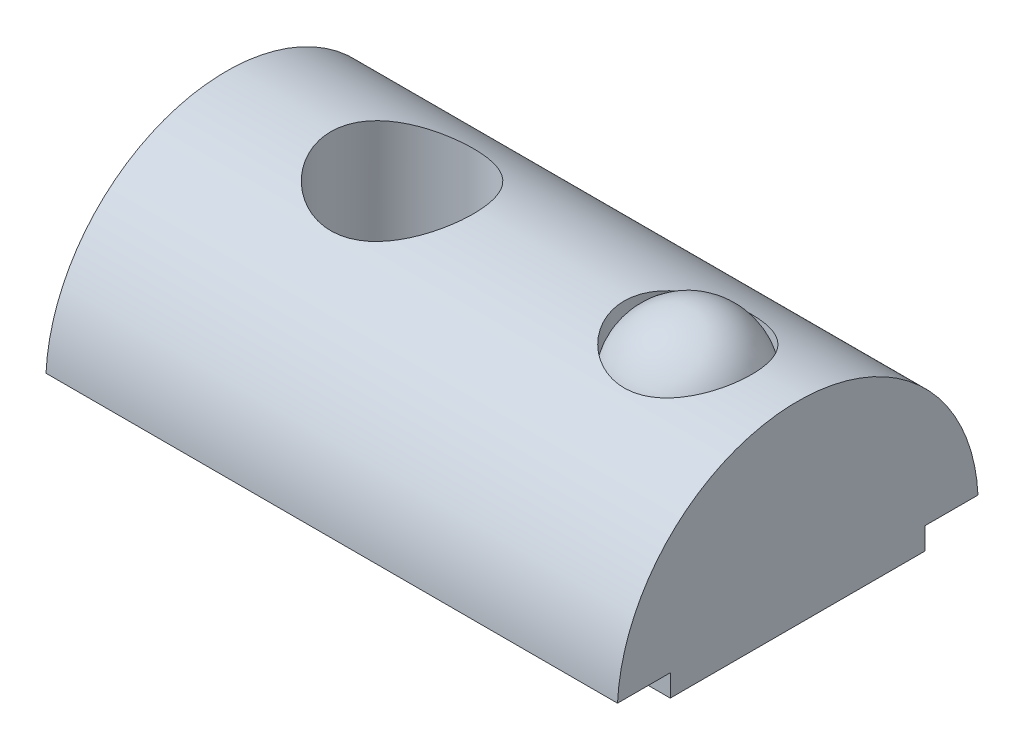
ISO-10303-21;
HEADER;
FILE_DESCRIPTION(('STEP AP214'),'2;1');
FILE_NAME('part.step','',(''),(''),'','','');
FILE_SCHEMA(('AUTOMOTIVE_DESIGN { 1 0 10303 214 1 1 1 1 }'));
ENDSEC;
DATA;
#1=APPLICATION_CONTEXT('core data for automotive mechanical design processes');
#2=APPLICATION_PROTOCOL_DEFINITION('international standard','automotive_design',2000,#1);
#3=PRODUCT_CONTEXT('',#1,'mechanical');
#4=PRODUCT('Part','Part','',(#3));
#5=PRODUCT_RELATED_PRODUCT_CATEGORY('part','',(#4));
#6=PRODUCT_DEFINITION_FORMATION('','',#4);
#7=PRODUCT_DEFINITION_CONTEXT('part definition',#1,'design');
#8=PRODUCT_DEFINITION('design','',#6,#7);
#9=PRODUCT_DEFINITION_SHAPE('','',#8);
#10=(LENGTH_UNIT() NAMED_UNIT(*) SI_UNIT(.MILLI.,.METRE.));
#11=(NAMED_UNIT(*) PLANE_ANGLE_UNIT() SI_UNIT($,.RADIAN.));
#12=(NAMED_UNIT(*) SI_UNIT($,.STERADIAN.) SOLID_ANGLE_UNIT());
#13=UNCERTAINTY_MEASURE_WITH_UNIT(LENGTH_MEASURE(1.E-05),#10,'distance_accuracy_value','');
#14=(GEOMETRIC_REPRESENTATION_CONTEXT(3) GLOBAL_UNCERTAINTY_ASSIGNED_CONTEXT((#13)) GLOBAL_UNIT_ASSIGNED_CONTEXT((#10,
#11,#12)) REPRESENTATION_CONTEXT('',''));
#15=CARTESIAN_POINT('',(0.,0.,0.));
#16=DIRECTION('',(0.,0.,1.));
#17=DIRECTION('',(1.,0.,0.));
#18=AXIS2_PLACEMENT_3D('',#15,#16,#17);
#19=CARTESIAN_POINT('',(6.5,0.,0.));
#20=DIRECTION('',(0.,-1.,0.));
#21=DIRECTION('',(0.,0.,-1.));
#22=AXIS2_PLACEMENT_3D('',#19,#20,#21);
#23=CYLINDRICAL_SURFACE('',#22,1.45);
#24=CARTESIAN_POINT('',(5.05,4.4,0.));
#25=CARTESIAN_POINT('',(5.04999859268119,4.40000099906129,-0.078842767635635));
#26=CARTESIAN_POINT('',(5.05645110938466,4.39770821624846,-0.15767548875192));
#27=CARTESIAN_POINT('',(5.08200001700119,4.38878913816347,-0.313002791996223));
#28=CARTESIAN_POINT('',(5.10109622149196,4.38216290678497,-0.38949740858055));
#29=CARTESIAN_POINT('',(5.15118497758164,4.36529291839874,-0.537886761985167));
#30=CARTESIAN_POINT('',(5.18215620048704,4.35505564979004,-0.609789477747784));
#31=CARTESIAN_POINT('',(5.2550138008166,4.33199662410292,-0.747377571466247));
#32=CARTESIAN_POINT('',(5.29690272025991,4.31917426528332,-0.813061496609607));
#33=CARTESIAN_POINT('',(5.39208844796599,4.29173320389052,-0.938864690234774));
#34=CARTESIAN_POINT('',(5.44572938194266,4.27706774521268,-0.998713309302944));
#35=CARTESIAN_POINT('',(5.56216551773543,4.24783766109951,-1.1087774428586));
#36=CARTESIAN_POINT('',(5.62496307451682,4.23327306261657,-1.15899047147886));
#37=CARTESIAN_POINT('',(5.76046226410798,4.20536583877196,-1.2499834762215));
#38=CARTESIAN_POINT('',(5.8334223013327,4.19207938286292,-1.29039757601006));
#39=CARTESIAN_POINT('',(5.9856481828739,4.16895141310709,-1.35826349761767));
#40=CARTESIAN_POINT('',(6.06491181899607,4.15910869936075,-1.38571983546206));
#41=CARTESIAN_POINT('',(6.22439747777,4.14447842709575,-1.42585063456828));
#42=CARTESIAN_POINT('',(6.30447422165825,4.13951647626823,-1.43903687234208));
#43=CARTESIAN_POINT('',(6.46584562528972,4.13469607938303,-1.45185348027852));
#44=CARTESIAN_POINT('',(6.54713984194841,4.13483581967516,-1.45148866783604));
#45=CARTESIAN_POINT('',(6.70413177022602,4.14005132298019,-1.43760804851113));
#46=CARTESIAN_POINT('',(6.77990028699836,4.14486935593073,-1.42477888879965));
#47=CARTESIAN_POINT('',(6.9281305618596,4.15847378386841,-1.38746084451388));
#48=CARTESIAN_POINT('',(7.00059187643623,4.16726070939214,-1.36297040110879));
#49=CARTESIAN_POINT('',(7.14163570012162,4.18798301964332,-1.30260983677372));
#50=CARTESIAN_POINT('',(7.2101282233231,4.1999707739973,-1.26654821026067));
#51=CARTESIAN_POINT('',(7.34029857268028,4.22572416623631,-1.18420203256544));
#52=CARTESIAN_POINT('',(7.401974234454,4.23949036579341,-1.13791424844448));
#53=CARTESIAN_POINT('',(7.52059277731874,4.26824304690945,-1.03320447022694));
#54=CARTESIAN_POINT('',(7.57704066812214,4.28325356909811,-0.974227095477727));
#55=CARTESIAN_POINT('',(7.67938243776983,4.31209777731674,-0.847462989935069));
#56=CARTESIAN_POINT('',(7.72527504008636,4.32593132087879,-0.779675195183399));
#57=CARTESIAN_POINT('',(7.805668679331,4.35108536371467,-0.636066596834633));
#58=CARTESIAN_POINT('',(7.84002222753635,4.36237276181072,-0.560157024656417));
#59=CARTESIAN_POINT('',(7.89531297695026,4.38092030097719,-0.403140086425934));
#60=CARTESIAN_POINT('',(7.91625543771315,4.38818202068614,-0.322034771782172));
#61=CARTESIAN_POINT('',(7.94321815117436,4.39759103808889,-0.161107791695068));
#62=CARTESIAN_POINT('',(7.94990615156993,4.39996700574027,-0.0814112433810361));
#63=CARTESIAN_POINT('',(7.95009183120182,4.40003228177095,0.0779905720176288));
#64=CARTESIAN_POINT('',(7.94359205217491,4.39772249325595,0.157695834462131));
#65=CARTESIAN_POINT('',(7.91810603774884,4.38882692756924,0.312081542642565));
#66=CARTESIAN_POINT('',(7.89954239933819,4.38238596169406,0.386840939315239));
#67=CARTESIAN_POINT('',(7.85099693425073,4.36602032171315,0.532144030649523));
#68=CARTESIAN_POINT('',(7.82101362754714,4.35609519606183,0.602687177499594));
#69=CARTESIAN_POINT('',(7.74956045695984,4.33341139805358,0.739755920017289));
#70=CARTESIAN_POINT('',(7.70779326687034,4.3205813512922,0.806114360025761));
#71=CARTESIAN_POINT('',(7.61430066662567,4.2935270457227,0.931090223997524));
#72=CARTESIAN_POINT('',(7.56257190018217,4.27930231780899,0.989705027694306));
#73=CARTESIAN_POINT('',(7.44749328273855,4.25013050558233,1.10066665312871));
#74=CARTESIAN_POINT('',(7.38368341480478,4.23518379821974,1.1525376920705));
#75=CARTESIAN_POINT('',(7.24795400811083,4.20698304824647,1.24491080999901));
#76=CARTESIAN_POINT('',(7.17603413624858,4.19372907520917,1.28541242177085));
#77=CARTESIAN_POINT('',(7.02586290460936,4.17051558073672,1.3538002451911));
#78=CARTESIAN_POINT('',(6.94760853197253,4.16055763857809,1.38168041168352));
#79=CARTESIAN_POINT('',(6.78707414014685,4.14527750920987,1.42371463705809));
#80=CARTESIAN_POINT('',(6.70479626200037,4.13995288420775,1.43787591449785));
#81=CARTESIAN_POINT('',(6.54363897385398,4.13484166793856,1.4514669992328));
#82=CARTESIAN_POINT('',(6.46483586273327,4.13475450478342,1.451696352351));
#83=CARTESIAN_POINT('',(6.30837805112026,4.13937209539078,1.43942247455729));
#84=CARTESIAN_POINT('',(6.23072326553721,4.14407649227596,1.42692019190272));
#85=CARTESIAN_POINT('',(6.08063909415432,4.15751054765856,1.39013172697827));
#86=CARTESIAN_POINT('',(6.00812904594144,4.16614094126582,1.36613541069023));
#87=CARTESIAN_POINT('',(5.86811356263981,4.18640761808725,1.30728362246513));
#88=CARTESIAN_POINT('',(5.80060932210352,4.19804461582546,1.27242556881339));
#89=CARTESIAN_POINT('',(5.66901206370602,4.22370761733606,1.19089625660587));
#90=CARTESIAN_POINT('',(5.60523732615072,4.23782135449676,1.14373912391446));
#91=CARTESIAN_POINT('',(5.48624921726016,4.26651217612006,1.03973892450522));
#92=CARTESIAN_POINT('',(5.43103841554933,4.28108939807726,0.982892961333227));
#93=CARTESIAN_POINT('',(5.32818371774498,4.30986600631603,0.858010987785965));
#94=CARTESIAN_POINT('',(5.28100181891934,4.32401756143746,0.789581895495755));
#95=CARTESIAN_POINT('',(5.19884587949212,4.34962842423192,0.645281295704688));
#96=CARTESIAN_POINT('',(5.16387053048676,4.36108802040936,0.569410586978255));
#97=CARTESIAN_POINT('',(5.10747414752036,4.37996651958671,0.412648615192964));
#98=CARTESIAN_POINT('',(5.08599794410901,4.38740185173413,0.331779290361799));
#99=CARTESIAN_POINT('',(5.05726423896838,4.39741716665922,0.167268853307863));
#100=CARTESIAN_POINT('',(5.05000149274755,4.39999894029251,0.0836287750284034));
#101=CARTESIAN_POINT('',(5.05,4.4,0.));
#102=B_SPLINE_CURVE_WITH_KNOTS('',3,(#24,#25,#26,#27,#28,#29,#30,#31,#32,#33,#34,#35,#36,#37,
#38,#39,#40,#41,#42,#43,#44,#45,#46,#47,#48,#49,#50,#51,#52,#53,#54,#55,#56,#57,#58,#59,#60,#61,
#62,#63,#64,#65,#66,#67,#68,#69,#70,#71,#72,#73,#74,#75,#76,#77,#78,#79,#80,#81,#82,#83,#84,#85,
#86,#87,#88,#89,#90,#91,#92,#93,#94,#95,#96,#97,#98,#99,#100,#101),.UNSPECIFIED.,.T.,.F.,(4,2,2,
2,2,2,2,2,2,2,2,2,2,2,2,2,2,2,2,2,2,2,2,2,2,2,2,2,2,2,2,2,2,2,2,2,2,2,4),(0.,0.236220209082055,
0.472436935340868,0.708231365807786,0.944080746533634,1.18807833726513,1.43213879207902,
1.68425139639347,1.93627606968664,2.17892768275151,2.42149303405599,2.65141171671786,
2.88136114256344,3.11533165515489,3.34937624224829,3.59725016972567,3.84515405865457,
4.096115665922,4.34697879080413,4.58580567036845,4.82458652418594,5.05542354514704,
5.28629049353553,5.52360311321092,5.76099582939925,6.01056639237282,6.26014720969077,
6.50984743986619,6.75941621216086,6.99464797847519,7.22986222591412,7.4594341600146,
7.68906070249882,7.92968636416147,8.17038408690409,8.42209853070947,8.6737859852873,
8.92443801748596,9.17499754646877),.UNSPECIFIED.);
#103=CARTESIAN_POINT('',(5.05,4.4,0.));
#104=VERTEX_POINT('',#103);
#105=EDGE_CURVE('E45',#104,#104,#102,.T.);
#106=ORIENTED_EDGE('',*,*,#105,.F.);
#107=EDGE_LOOP('',(#106));
#108=FACE_BOUND('',#107,.T.);
#109=CARTESIAN_POINT('',(6.5,3.88405728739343,0.));
#110=DIRECTION('',(0.,-1.,0.));
#111=DIRECTION('',(0.,0.,-1.));
#112=AXIS2_PLACEMENT_3D('',#109,#110,#111);
#113=CIRCLE('',#112,1.45);
#114=CARTESIAN_POINT('',(6.5,3.88405728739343,-1.45));
#115=VERTEX_POINT('',#114);
#116=EDGE_CURVE('E11',#115,#115,#113,.F.);
#117=ORIENTED_EDGE('',*,*,#116,.F.);
#118=EDGE_LOOP('',(#117));
#119=FACE_BOUND('',#118,.T.);
#120=ADVANCED_FACE('F35',(#108,#119),#23,.F.);
#121=CARTESIAN_POINT('',(9.,0.294871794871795,0.));
#122=DIRECTION('',(-1.,0.,0.));
#123=DIRECTION('',(0.,0.,1.));
#124=AXIS2_PLACEMENT_3D('',#121,#122,#123);
#125=CYLINDRICAL_SURFACE('',#124,4.1051282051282);
#126=ORIENTED_EDGE('',*,*,#105,.T.);
#127=EDGE_LOOP('',(#126));
#128=FACE_BOUND('',#127,.T.);
#129=CARTESIAN_POINT('',(-1.621,4.4,0.));
#130=CARTESIAN_POINT('',(-1.6209910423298,4.39999348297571,-0.0872351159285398));
#131=CARTESIAN_POINT('',(-1.61391806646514,4.39718734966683,-0.174599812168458));
#132=CARTESIAN_POINT('',(-1.58586906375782,4.38623575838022,-0.346865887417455));
#133=CARTESIAN_POINT('',(-1.56485766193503,4.37807671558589,-0.431760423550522));
#134=CARTESIAN_POINT('',(-1.50981328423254,4.35730053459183,-0.596326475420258));
#135=CARTESIAN_POINT('',(-1.47582151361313,4.34469751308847,-0.676013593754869));
#136=CARTESIAN_POINT('',(-1.39594396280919,4.31627790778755,-0.828488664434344));
#137=CARTESIAN_POINT('',(-1.35006177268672,4.30046229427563,-0.901278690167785));
#138=CARTESIAN_POINT('',(-1.24546980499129,4.26640650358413,-1.04134652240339));
#139=CARTESIAN_POINT('',(-1.18630209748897,4.24809238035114,-1.10826427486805));
#140=CARTESIAN_POINT('',(-1.05778553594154,4.21144635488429,-1.23152945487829));
#141=CARTESIAN_POINT('',(-0.988431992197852,4.19311444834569,-1.28787198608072));
#142=CARTESIAN_POINT('',(-0.837877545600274,4.15763063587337,-1.39077915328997));
#143=CARTESIAN_POINT('',(-0.75629469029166,4.14056371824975,-1.43681729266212));
#144=CARTESIAN_POINT('',(-0.585767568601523,4.11069913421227,-1.51435754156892));
#145=CARTESIAN_POINT('',(-0.496826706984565,4.09789950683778,-1.54586633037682));
#146=CARTESIAN_POINT('',(-0.31824394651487,4.07881115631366,-1.59200581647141));
#147=CARTESIAN_POINT('',(-0.228809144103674,4.07225818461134,-1.60732482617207));
#148=CARTESIAN_POINT('',(-0.0484168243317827,4.06563753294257,-1.62280052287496));
#149=CARTESIAN_POINT('',(0.0425399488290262,4.0655667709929,-1.62296441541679));
#150=CARTESIAN_POINT('',(0.216848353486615,4.07169258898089,-1.60864785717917));
#151=CARTESIAN_POINT('',(0.300298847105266,4.07746636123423,-1.59515535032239));
#152=CARTESIAN_POINT('',(0.463637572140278,4.09392251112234,-1.5555533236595));
#153=CARTESIAN_POINT('',(0.543525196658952,4.10460572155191,-1.5294416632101));
#154=CARTESIAN_POINT('',(0.699368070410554,4.12990910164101,-1.46485011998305));
#155=CARTESIAN_POINT('',(0.775211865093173,4.14460415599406,-1.42613196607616));
#156=CARTESIAN_POINT('',(0.919599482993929,4.17625396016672,-1.33759350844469));
#157=CARTESIAN_POINT('',(0.98814059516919,4.19320954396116,-1.28776910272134));
#158=CARTESIAN_POINT('',(1.12139818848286,4.22902266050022,-1.17402902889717));
#159=CARTESIAN_POINT('',(1.1854399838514,4.24792735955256,-1.10933570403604));
#160=CARTESIAN_POINT('',(1.30197825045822,4.2844225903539,-0.969922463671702));
#161=CARTESIAN_POINT('',(1.35447253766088,4.30201287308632,-0.895200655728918));
#162=CARTESIAN_POINT('',(1.44728074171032,4.33431800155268,-0.735978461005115));
#163=CARTESIAN_POINT('',(1.48734696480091,4.34897253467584,-0.651320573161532));
#164=CARTESIAN_POINT('',(1.55243846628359,4.37330090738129,-0.475741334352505));
#165=CARTESIAN_POINT('',(1.57747118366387,4.38297720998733,-0.384823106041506));
#166=CARTESIAN_POINT('',(1.61043478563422,4.3958133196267,-0.204964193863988));
#167=CARTESIAN_POINT('',(1.61927274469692,4.39931829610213,-0.116214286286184));
#168=CARTESIAN_POINT('',(1.62226654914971,4.40049979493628,0.0615607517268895));
#169=CARTESIAN_POINT('',(1.61642608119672,4.3981777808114,0.150585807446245));
#170=CARTESIAN_POINT('',(1.59090070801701,4.38819259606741,0.322312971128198));
#171=CARTESIAN_POINT('',(1.57182972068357,4.38076640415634,0.405121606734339));
#172=CARTESIAN_POINT('',(1.52121432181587,4.36156375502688,0.566291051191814));
#173=CARTESIAN_POINT('',(1.48966830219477,4.34978673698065,0.644651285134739));
#174=CARTESIAN_POINT('',(1.41397202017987,4.32258467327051,0.797376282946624));
#175=CARTESIAN_POINT('',(1.36946789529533,4.30705965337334,0.871547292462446));
#176=CARTESIAN_POINT('',(1.26951270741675,4.27405208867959,1.01162699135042));
#177=CARTESIAN_POINT('',(1.21405732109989,4.25656877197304,1.07753240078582));
#178=CARTESIAN_POINT('',(1.08958504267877,4.22015784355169,1.20365723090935));
#179=CARTESIAN_POINT('',(1.01992504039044,4.20120969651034,1.26323770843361));
#180=CARTESIAN_POINT('',(0.871251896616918,4.16505602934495,1.37001385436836));
#181=CARTESIAN_POINT('',(0.792237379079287,4.14785076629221,1.41720769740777));
#182=CARTESIAN_POINT('',(0.626027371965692,4.11712708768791,1.49811211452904));
#183=CARTESIAN_POINT('',(0.538768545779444,4.10364096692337,1.53170569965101));
#184=CARTESIAN_POINT('',(0.359141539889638,4.08241678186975,1.58347029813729));
#185=CARTESIAN_POINT('',(0.266777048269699,4.07467462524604,1.60165229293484));
#186=CARTESIAN_POINT('',(0.0865661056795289,4.06639702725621,1.62104157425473));
#187=CARTESIAN_POINT('',(-0.00114073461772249,4.06539267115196,1.62335361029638));
#188=CARTESIAN_POINT('',(-0.175628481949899,4.06948137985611,1.61382365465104));
#189=CARTESIAN_POINT('',(-0.262409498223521,4.07457371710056,1.60198335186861));
#190=CARTESIAN_POINT('',(-0.429249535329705,4.08987315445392,1.5653786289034));
#191=CARTESIAN_POINT('',(-0.509438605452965,4.09988102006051,1.54111619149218));
#192=CARTESIAN_POINT('',(-0.664642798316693,4.12374843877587,1.48081975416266));
#193=CARTESIAN_POINT('',(-0.739656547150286,4.13760900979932,1.44478264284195));
#194=CARTESIAN_POINT('',(-0.886979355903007,4.1685893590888,1.35961416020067));
#195=CARTESIAN_POINT('',(-0.958898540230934,4.18584867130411,1.30985994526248));
#196=CARTESIAN_POINT('',(-1.09371852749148,4.22124633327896,1.19958763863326));
#197=CARTESIAN_POINT('',(-1.15661613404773,4.23938499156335,1.13906574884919));
#198=CARTESIAN_POINT('',(-1.27563988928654,4.27586194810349,1.00446500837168));
#199=CARTESIAN_POINT('',(-1.33109510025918,4.29414158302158,0.929774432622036));
#200=CARTESIAN_POINT('',(-1.42867492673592,4.32766755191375,0.771470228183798));
#201=CARTESIAN_POINT('',(-1.47079781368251,4.34291349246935,0.687855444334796));
#202=CARTESIAN_POINT('',(-1.53723306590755,4.367543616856,0.521432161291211));
#203=CARTESIAN_POINT('',(-1.56275877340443,4.37731706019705,0.439164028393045));
#204=CARTESIAN_POINT('',(-1.60042753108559,4.3918821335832,0.271340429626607));
#205=CARTESIAN_POINT('',(-1.61260727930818,4.39668742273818,0.185794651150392));
#206=CARTESIAN_POINT('',(-1.61997596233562,4.3995964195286,0.0666310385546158));
#207=CARTESIAN_POINT('',(-1.62100342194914,4.40000248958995,0.0333249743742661));
#208=CARTESIAN_POINT('',(-1.621,4.4,0.));
#209=B_SPLINE_CURVE_WITH_KNOTS('',3,(#129,#130,#131,#132,#133,#134,#135,#136,#137,#138,#139,
#140,#141,#142,#143,#144,#145,#146,#147,#148,#149,#150,#151,#152,#153,#154,#155,#156,#157,#158,
#159,#160,#161,#162,#163,#164,#165,#166,#167,#168,#169,#170,#171,#172,#173,#174,#175,#176,#177,
#178,#179,#180,#181,#182,#183,#184,#185,#186,#187,#188,#189,#190,#191,#192,#193,#194,#195,#196,
#197,#198,#199,#200,#201,#202,#203,#204,#205,#206,#207,#208),.UNSPECIFIED.,.T.,.F.,(4,2,2,2,2,2,
2,2,2,2,2,2,2,2,2,2,2,2,2,2,2,2,2,2,2,2,2,2,2,2,2,2,2,2,2,2,2,2,2,4),(0.,0.261606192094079,
0.523878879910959,0.785325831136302,1.04669393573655,1.31904263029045,1.59151711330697,
1.87574282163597,2.15983773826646,2.43129784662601,2.70262888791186,2.95564141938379,
3.20869688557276,3.46684366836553,3.72508595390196,4.0027383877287,4.28044329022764,
4.56337197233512,4.84616053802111,5.112559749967,5.37889205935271,5.63362716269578,
5.88839511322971,6.15090436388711,6.41351745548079,6.69303230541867,6.97258832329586,
7.25450043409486,7.5362115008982,7.79809317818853,8.05994360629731,8.3119617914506,
8.56404662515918,8.83032002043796,9.09668752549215,9.37973988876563,9.66282893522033,
9.92175463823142,10.1799665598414,10.2799036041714),.UNSPECIFIED.);
#210=CARTESIAN_POINT('',(-1.621,4.4,0.));
#211=VERTEX_POINT('',#210);
#212=EDGE_CURVE('E142',#211,#211,#209,.T.);
#213=ORIENTED_EDGE('',*,*,#212,.T.);
#214=EDGE_LOOP('',(#213));
#215=FACE_BOUND('',#214,.T.);
#216=CARTESIAN_POINT('',(-4.,0.294871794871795,0.));
#217=DIRECTION('',(1.,0.,0.));
#218=DIRECTION('',(0.,0.,-1.));
#219=AXIS2_PLACEMENT_3D('',#216,#217,#218);
#220=CIRCLE('',#219,4.1051282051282);
#221=CARTESIAN_POINT('',(-4.,0.500000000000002,-4.1));
#222=VERTEX_POINT('',#221);
#223=CARTESIAN_POINT('',(-4.,0.5,4.1));
#224=VERTEX_POINT('',#223);
#225=EDGE_CURVE('E122',#222,#224,#220,.T.);
#226=ORIENTED_EDGE('',*,*,#225,.T.);
#227=DIRECTION('',(-1.,0.,0.));
#228=VECTOR('',#227,1.);
#229=CARTESIAN_POINT('',(9.,0.5,4.1));
#230=LINE('',#229,#228);
#231=CARTESIAN_POINT('',(9.,0.5,4.1));
#232=VERTEX_POINT('',#231);
#233=EDGE_CURVE('E140',#232,#224,#230,.T.);
#234=ORIENTED_EDGE('',*,*,#233,.F.);
#235=CARTESIAN_POINT('',(9.,0.294871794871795,0.));
#236=DIRECTION('',(1.,0.,0.));
#237=DIRECTION('',(0.,0.,-1.));
#238=AXIS2_PLACEMENT_3D('',#235,#236,#237);
#239=CIRCLE('',#238,4.1051282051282);
#240=CARTESIAN_POINT('',(9.,0.500000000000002,-4.1));
#241=VERTEX_POINT('',#240);
#242=EDGE_CURVE('E133',#241,#232,#239,.T.);
#243=ORIENTED_EDGE('',*,*,#242,.F.);
#244=DIRECTION('',(-1.,0.,0.));
#245=VECTOR('',#244,1.);
#246=CARTESIAN_POINT('',(9.,0.500000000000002,-4.1));
#247=LINE('',#246,#245);
#248=EDGE_CURVE('E118',#241,#222,#247,.T.);
#249=ORIENTED_EDGE('',*,*,#248,.T.);
#250=EDGE_LOOP('',(#226,#234,#243,#249));
#251=FACE_BOUND('',#250,.T.);
#252=ADVANCED_FACE('F37',(#128,#215,#251),#125,.T.);
#253=CARTESIAN_POINT('',(9.,0.499999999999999,2.9));
#254=DIRECTION('',(0.,1.,0.));
#255=DIRECTION('',(0.,0.,1.));
#256=AXIS2_PLACEMENT_3D('',#253,#254,#255);
#257=PLANE('',#256);
#258=DIRECTION('',(0.,0.,-1.));
#259=VECTOR('',#258,1.);
#260=CARTESIAN_POINT('',(-4.,0.499999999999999,2.9));
#261=LINE('',#260,#259);
#262=CARTESIAN_POINT('',(-4.,0.499999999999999,2.9));
#263=VERTEX_POINT('',#262);
#264=EDGE_CURVE('E125',#224,#263,#261,.T.);
#265=ORIENTED_EDGE('',*,*,#264,.T.);
#266=DIRECTION('',(-1.,0.,0.));
#267=VECTOR('',#266,1.);
#268=CARTESIAN_POINT('',(9.,0.499999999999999,2.9));
#269=LINE('',#268,#267);
#270=CARTESIAN_POINT('',(9.,0.499999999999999,2.9));
#271=VERTEX_POINT('',#270);
#272=EDGE_CURVE('E137',#271,#263,#269,.T.);
#273=ORIENTED_EDGE('',*,*,#272,.F.);
#274=DIRECTION('',(0.,0.,-1.));
#275=VECTOR('',#274,1.);
#276=CARTESIAN_POINT('',(9.,0.499999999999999,2.9));
#277=LINE('',#276,#275);
#278=EDGE_CURVE('E91',#232,#271,#277,.T.);
#279=ORIENTED_EDGE('',*,*,#278,.F.);
#280=ORIENTED_EDGE('',*,*,#233,.T.);
#281=EDGE_LOOP('',(#265,#273,#279,#280));
#282=FACE_BOUND('',#281,.T.);
#283=ADVANCED_FACE('F174',(#282),#257,.F.);
#284=CARTESIAN_POINT('',(9.,0.,2.9));
#285=DIRECTION('',(0.,0.,-1.));
#286=DIRECTION('',(-1.,0.,0.));
#287=AXIS2_PLACEMENT_3D('',#284,#285,#286);
#288=PLANE('',#287);
#289=DIRECTION('',(0.,-1.,0.));
#290=VECTOR('',#289,1.);
#291=CARTESIAN_POINT('',(-4.,0.,2.9));
#292=LINE('',#291,#290);
#293=CARTESIAN_POINT('',(-4.,0.,2.9));
#294=VERTEX_POINT('',#293);
#295=EDGE_CURVE('E128',#263,#294,#292,.T.);
#296=ORIENTED_EDGE('',*,*,#295,.T.);
#297=DIRECTION('',(-1.,0.,0.));
#298=VECTOR('',#297,1.);
#299=CARTESIAN_POINT('',(9.,0.,2.9));
#300=LINE('',#299,#298);
#301=CARTESIAN_POINT('',(9.,0.,2.9));
#302=VERTEX_POINT('',#301);
#303=EDGE_CURVE('E113',#302,#294,#300,.T.);
#304=ORIENTED_EDGE('',*,*,#303,.F.);
#305=DIRECTION('',(0.,-1.,0.));
#306=VECTOR('',#305,1.);
#307=CARTESIAN_POINT('',(9.,0.,2.9));
#308=LINE('',#307,#306);
#309=EDGE_CURVE('E104',#271,#302,#308,.T.);
#310=ORIENTED_EDGE('',*,*,#309,.F.);
#311=ORIENTED_EDGE('',*,*,#272,.T.);
#312=EDGE_LOOP('',(#296,#304,#310,#311));
#313=FACE_BOUND('',#312,.T.);
#314=ADVANCED_FACE('F171',(#313),#288,.F.);
#315=CARTESIAN_POINT('',(9.,0.,-2.9));
#316=DIRECTION('',(0.,1.,0.));
#317=DIRECTION('',(0.,0.,1.));
#318=AXIS2_PLACEMENT_3D('',#315,#316,#317);
#319=PLANE('',#318);
#320=CARTESIAN_POINT('',(0.,0.,0.));
#321=DIRECTION('',(0.,-1.,0.));
#322=DIRECTION('',(0.,0.,-1.));
#323=AXIS2_PLACEMENT_3D('',#320,#321,#322);
#324=CIRCLE('',#323,1.621);
#325=CARTESIAN_POINT('',(0.,0.,-1.621));
#326=VERTEX_POINT('',#325);
#327=EDGE_CURVE('E126',#326,#326,#324,.T.);
#328=ORIENTED_EDGE('',*,*,#327,.F.);
#329=EDGE_LOOP('',(#328));
#330=FACE_BOUND('',#329,.T.);
#331=DIRECTION('',(0.,0.,-1.));
#332=VECTOR('',#331,1.);
#333=CARTESIAN_POINT('',(-4.,0.,-2.9));
#334=LINE('',#333,#332);
#335=CARTESIAN_POINT('',(-4.,0.,-2.9));
#336=VERTEX_POINT('',#335);
#337=EDGE_CURVE('E112',#294,#336,#334,.T.);
#338=ORIENTED_EDGE('',*,*,#337,.T.);
#339=DIRECTION('',(-1.,0.,0.));
#340=VECTOR('',#339,1.);
#341=CARTESIAN_POINT('',(9.,0.,-2.9));
#342=LINE('',#341,#340);
#343=CARTESIAN_POINT('',(9.,0.,-2.9));
#344=VERTEX_POINT('',#343);
#345=EDGE_CURVE('E109',#344,#336,#342,.T.);
#346=ORIENTED_EDGE('',*,*,#345,.F.);
#347=DIRECTION('',(0.,0.,-1.));
#348=VECTOR('',#347,1.);
#349=CARTESIAN_POINT('',(9.,0.,-2.9));
#350=LINE('',#349,#348);
#351=EDGE_CURVE('E98',#302,#344,#350,.T.);
#352=ORIENTED_EDGE('',*,*,#351,.F.);
#353=ORIENTED_EDGE('',*,*,#303,.T.);
#354=EDGE_LOOP('',(#338,#346,#352,#353));
#355=FACE_BOUND('',#354,.T.);
#356=ADVANCED_FACE('F110',(#330,#355),#319,.F.);
#357=CARTESIAN_POINT('',(9.,0.499999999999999,-2.9));
#358=DIRECTION('',(0.,0.,1.));
#359=DIRECTION('',(1.,0.,0.));
#360=AXIS2_PLACEMENT_3D('',#357,#358,#359);
#361=PLANE('',#360);
#362=DIRECTION('',(0.,1.,0.));
#363=VECTOR('',#362,1.);
#364=CARTESIAN_POINT('',(-4.,0.499999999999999,-2.9));
#365=LINE('',#364,#363);
#366=CARTESIAN_POINT('',(-4.,0.499999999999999,-2.9));
#367=VERTEX_POINT('',#366);
#368=EDGE_CURVE('E76',#336,#367,#365,.T.);
#369=ORIENTED_EDGE('',*,*,#368,.T.);
#370=DIRECTION('',(-1.,0.,0.));
#371=VECTOR('',#370,1.);
#372=CARTESIAN_POINT('',(9.,0.499999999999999,-2.9));
#373=LINE('',#372,#371);
#374=CARTESIAN_POINT('',(9.,0.499999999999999,-2.9));
#375=VERTEX_POINT('',#374);
#376=EDGE_CURVE('E114',#375,#367,#373,.T.);
#377=ORIENTED_EDGE('',*,*,#376,.F.);
#378=DIRECTION('',(0.,1.,0.));
#379=VECTOR('',#378,1.);
#380=CARTESIAN_POINT('',(9.,0.499999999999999,-2.9));
#381=LINE('',#380,#379);
#382=EDGE_CURVE('E102',#344,#375,#381,.T.);
#383=ORIENTED_EDGE('',*,*,#382,.F.);
#384=ORIENTED_EDGE('',*,*,#345,.T.);
#385=EDGE_LOOP('',(#369,#377,#383,#384));
#386=FACE_BOUND('',#385,.T.);
#387=ADVANCED_FACE('F116',(#386),#361,.F.);
#388=CARTESIAN_POINT('',(9.,0.500000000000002,-4.1));
#389=DIRECTION('',(0.,1.,0.));
#390=DIRECTION('',(0.,0.,1.));
#391=AXIS2_PLACEMENT_3D('',#388,#389,#390);
#392=PLANE('',#391);
#393=DIRECTION('',(0.,0.,-1.));
#394=VECTOR('',#393,1.);
#395=CARTESIAN_POINT('',(-4.,0.500000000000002,-4.1));
#396=LINE('',#395,#394);
#397=EDGE_CURVE('E82',#367,#222,#396,.T.);
#398=ORIENTED_EDGE('',*,*,#397,.T.);
#399=ORIENTED_EDGE('',*,*,#248,.F.);
#400=DIRECTION('',(0.,0.,-1.));
#401=VECTOR('',#400,1.);
#402=CARTESIAN_POINT('',(9.,0.500000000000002,-4.1));
#403=LINE('',#402,#401);
#404=EDGE_CURVE('E53',#375,#241,#403,.T.);
#405=ORIENTED_EDGE('',*,*,#404,.F.);
#406=ORIENTED_EDGE('',*,*,#376,.T.);
#407=EDGE_LOOP('',(#398,#399,#405,#406));
#408=FACE_BOUND('',#407,.T.);
#409=ADVANCED_FACE('F161',(#408),#392,.F.);
#410=CARTESIAN_POINT('',(9.,0.294871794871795,0.));
#411=DIRECTION('',(1.,0.,0.));
#412=DIRECTION('',(0.,0.,-1.));
#413=AXIS2_PLACEMENT_3D('',#410,#411,#412);
#414=PLANE('',#413);
#415=ORIENTED_EDGE('',*,*,#242,.T.);
#416=ORIENTED_EDGE('',*,*,#278,.T.);
#417=ORIENTED_EDGE('',*,*,#309,.T.);
#418=ORIENTED_EDGE('',*,*,#351,.T.);
#419=ORIENTED_EDGE('',*,*,#382,.T.);
#420=ORIENTED_EDGE('',*,*,#404,.T.);
#421=EDGE_LOOP('',(#415,#416,#417,#418,#419,#420));
#422=FACE_BOUND('',#421,.T.);
#423=ADVANCED_FACE('F100',(#422),#414,.T.);
#424=CARTESIAN_POINT('',(-4.,0.294871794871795,0.));
#425=DIRECTION('',(1.,0.,0.));
#426=DIRECTION('',(0.,0.,-1.));
#427=AXIS2_PLACEMENT_3D('',#424,#425,#426);
#428=PLANE('',#427);
#429=ORIENTED_EDGE('',*,*,#225,.F.);
#430=ORIENTED_EDGE('',*,*,#397,.F.);
#431=ORIENTED_EDGE('',*,*,#368,.F.);
#432=ORIENTED_EDGE('',*,*,#337,.F.);
#433=ORIENTED_EDGE('',*,*,#295,.F.);
#434=ORIENTED_EDGE('',*,*,#264,.F.);
#435=EDGE_LOOP('',(#429,#430,#431,#432,#433,#434));
#436=FACE_BOUND('',#435,.T.);
#437=ADVANCED_FACE('F155',(#436),#428,.F.);
#438=CARTESIAN_POINT('',(0.,0.,0.));
#439=DIRECTION('',(0.,-1.,0.));
#440=DIRECTION('',(0.,0.,-1.));
#441=AXIS2_PLACEMENT_3D('',#438,#439,#440);
#442=CYLINDRICAL_SURFACE('',#441,1.621);
#443=ORIENTED_EDGE('',*,*,#327,.T.);
#444=EDGE_LOOP('',(#443));
#445=FACE_BOUND('',#444,.T.);
#446=ORIENTED_EDGE('',*,*,#212,.F.);
#447=EDGE_LOOP('',(#446));
#448=FACE_BOUND('',#447,.T.);
#449=ADVANCED_FACE('F150',(#445,#448),#442,.F.);
#450=CARTESIAN_POINT('',(6.5,3.5,0.));
#451=DIRECTION('',(0.,1.,0.));
#452=DIRECTION('',(1.,0.,0.));
#453=AXIS2_PLACEMENT_3D('',#450,#451,#452);
#454=SPHERICAL_SURFACE('',#453,1.5);
#455=ORIENTED_EDGE('',*,*,#116,.T.);
#456=EDGE_LOOP('',(#455));
#457=FACE_BOUND('',#456,.T.);
#458=ADVANCED_FACE('F154',(#457),#454,.T.);
#459=CLOSED_SHELL('',(#120,#252,#283,#314,#356,#387,#409,#423,#437,#449,#458));
#460=MANIFOLD_SOLID_BREP('B2',#459);
#461=ADVANCED_BREP_SHAPE_REPRESENTATION('',(#18,#460),#14);
#462=SHAPE_DEFINITION_REPRESENTATION(#9,#461);
ENDSEC;
END-ISO-10303-21;
